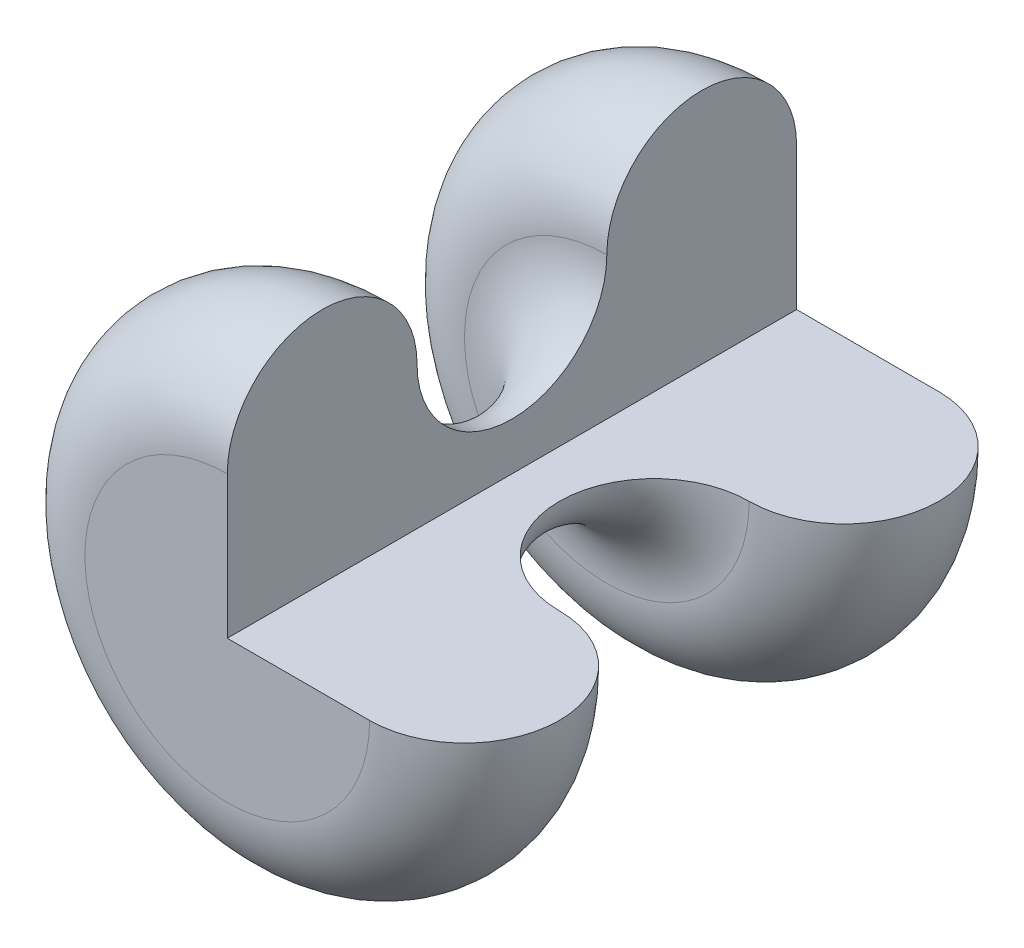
ISO-10303-21;
HEADER;
FILE_DESCRIPTION(('STEP AP214'),'2;1');
FILE_NAME('part.step','',(''),(''),'','','');
FILE_SCHEMA(('AUTOMOTIVE_DESIGN { 1 0 10303 214 1 1 1 1 }'));
ENDSEC;
DATA;
#1=APPLICATION_CONTEXT('core data for automotive mechanical design processes');
#2=APPLICATION_PROTOCOL_DEFINITION('international standard','automotive_design',2000,#1);
#3=PRODUCT_CONTEXT('',#1,'mechanical');
#4=PRODUCT('Part','Part','',(#3));
#5=PRODUCT_RELATED_PRODUCT_CATEGORY('part','',(#4));
#6=PRODUCT_DEFINITION_FORMATION('','',#4);
#7=PRODUCT_DEFINITION_CONTEXT('part definition',#1,'design');
#8=PRODUCT_DEFINITION('design','',#6,#7);
#9=PRODUCT_DEFINITION_SHAPE('','',#8);
#10=(LENGTH_UNIT() NAMED_UNIT(*) SI_UNIT(.MILLI.,.METRE.));
#11=(NAMED_UNIT(*) PLANE_ANGLE_UNIT() SI_UNIT($,.RADIAN.));
#12=(NAMED_UNIT(*) SI_UNIT($,.STERADIAN.) SOLID_ANGLE_UNIT());
#13=UNCERTAINTY_MEASURE_WITH_UNIT(LENGTH_MEASURE(1.E-05),#10,'distance_accuracy_value','');
#14=(GEOMETRIC_REPRESENTATION_CONTEXT(3) GLOBAL_UNCERTAINTY_ASSIGNED_CONTEXT((#13)) GLOBAL_UNIT_ASSIGNED_CONTEXT((#10,
#11,#12)) REPRESENTATION_CONTEXT('',''));
#15=CARTESIAN_POINT('',(0.,0.,0.));
#16=DIRECTION('',(0.,0.,1.));
#17=DIRECTION('',(1.,0.,0.));
#18=AXIS2_PLACEMENT_3D('',#15,#16,#17);
#19=CARTESIAN_POINT('',(0.,0.,24.3622568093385));
#20=DIRECTION('',(0.,0.,1.));
#21=DIRECTION('',(1.,0.,0.));
#22=AXIS2_PLACEMENT_3D('',#19,#20,#21);
#23=PLANE('',#22);
#24=CARTESIAN_POINT('',(0.,0.,24.3622568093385));
#25=DIRECTION('',(0.,0.,1.));
#26=DIRECTION('',(1.,0.,0.));
#27=AXIS2_PLACEMENT_3D('',#24,#25,#26);
#28=CIRCLE('',#27,30.2428015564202);
#29=CARTESIAN_POINT('',(3.02898743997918E-13,30.2428015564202,24.3622568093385));
#30=VERTEX_POINT('',#29);
#31=CARTESIAN_POINT('',(30.2428015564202,0.,24.3622568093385));
#32=VERTEX_POINT('',#31);
#33=EDGE_CURVE('E11',#30,#32,#28,.T.);
#34=ORIENTED_EDGE('',*,*,#33,.T.);
#35=DIRECTION('',(1.,0.,0.));
#36=VECTOR('',#35,1.);
#37=CARTESIAN_POINT('',(0.,0.,24.3622568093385));
#38=LINE('',#37,#36);
#39=CARTESIAN_POINT('',(0.,0.,24.3622568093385));
#40=VERTEX_POINT('',#39);
#41=EDGE_CURVE('E79',#40,#32,#38,.T.);
#42=ORIENTED_EDGE('',*,*,#41,.F.);
#43=DIRECTION('',(0.,1.,0.));
#44=VECTOR('',#43,1.);
#45=CARTESIAN_POINT('',(0.,0.,24.3622568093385));
#46=LINE('',#45,#44);
#47=EDGE_CURVE('E81',#40,#30,#46,.T.);
#48=ORIENTED_EDGE('',*,*,#47,.T.);
#49=EDGE_LOOP('',(#34,#42,#48));
#50=FACE_BOUND('',#49,.T.);
#51=ADVANCED_FACE('F32',(#50),#23,.T.);
#52=CARTESIAN_POINT('',(0.,0.,4.20038910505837));
#53=DIRECTION('',(0.,0.,1.));
#54=DIRECTION('',(1.,0.,0.));
#55=AXIS2_PLACEMENT_3D('',#52,#53,#54);
#56=TOROIDAL_SURFACE('',#55,30.2428015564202,20.1618677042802);
#57=CARTESIAN_POINT('',(0.,0.,-15.9614785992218));
#58=DIRECTION('',(0.,0.,1.));
#59=DIRECTION('',(1.,0.,0.));
#60=AXIS2_PLACEMENT_3D('',#57,#58,#59);
#61=CIRCLE('',#60,30.2428015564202);
#62=CARTESIAN_POINT('',(3.02898743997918E-13,30.2428015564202,-15.9614785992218));
#63=VERTEX_POINT('',#62);
#64=CARTESIAN_POINT('',(30.2428015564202,0.,-15.9614785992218));
#65=VERTEX_POINT('',#64);
#66=EDGE_CURVE('E39',#63,#65,#61,.T.);
#67=ORIENTED_EDGE('',*,*,#66,.T.);
#68=CARTESIAN_POINT('',(30.2428015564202,0.,4.20038910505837));
#69=DIRECTION('',(0.,1.,0.));
#70=DIRECTION('',(0.,0.,1.));
#71=AXIS2_PLACEMENT_3D('',#68,#69,#70);
#72=CIRCLE('',#71,20.1618677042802);
#73=EDGE_CURVE('E89',#32,#65,#72,.T.);
#74=ORIENTED_EDGE('',*,*,#73,.F.);
#75=ORIENTED_EDGE('',*,*,#33,.F.);
#76=CARTESIAN_POINT('',(3.02898743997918E-13,30.2428015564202,4.20038910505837));
#77=DIRECTION('',(-1.,0.,0.));
#78=DIRECTION('',(0.,0.,1.));
#79=AXIS2_PLACEMENT_3D('',#76,#77,#78);
#80=CIRCLE('',#79,20.1618677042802);
#81=EDGE_CURVE('E103',#30,#63,#80,.T.);
#82=ORIENTED_EDGE('',*,*,#81,.T.);
#83=EDGE_LOOP('',(#67,#74,#75,#82));
#84=FACE_BOUND('',#83,.T.);
#85=ADVANCED_FACE('F93',(#84),#56,.T.);
#86=CARTESIAN_POINT('',(0.,0.,-36.1233463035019));
#87=DIRECTION('',(0.,0.,1.));
#88=DIRECTION('',(1.,0.,0.));
#89=AXIS2_PLACEMENT_3D('',#86,#87,#88);
#90=TOROIDAL_SURFACE('',#89,30.2428015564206,20.1618677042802);
#91=CARTESIAN_POINT('',(0.,0.,-56.2852140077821));
#92=DIRECTION('',(0.,0.,1.));
#93=DIRECTION('',(1.,0.,0.));
#94=AXIS2_PLACEMENT_3D('',#91,#92,#93);
#95=CIRCLE('',#94,30.2428015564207);
#96=CARTESIAN_POINT('',(3.02898743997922E-13,30.2428015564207,-56.2852140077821));
#97=VERTEX_POINT('',#96);
#98=CARTESIAN_POINT('',(30.2428015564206,0.,-56.2852140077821));
#99=VERTEX_POINT('',#98);
#100=EDGE_CURVE('E113',#97,#99,#95,.T.);
#101=ORIENTED_EDGE('',*,*,#100,.T.);
#102=CARTESIAN_POINT('',(30.2428015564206,0.,-36.1233463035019));
#103=DIRECTION('',(0.,-1.,0.));
#104=DIRECTION('',(0.,0.,-1.));
#105=AXIS2_PLACEMENT_3D('',#102,#103,#104);
#106=CIRCLE('',#105,20.1618677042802);
#107=EDGE_CURVE('E94',#65,#99,#106,.T.);
#108=ORIENTED_EDGE('',*,*,#107,.F.);
#109=ORIENTED_EDGE('',*,*,#66,.F.);
#110=CARTESIAN_POINT('',(3.02898743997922E-13,30.2428015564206,-36.1233463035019));
#111=DIRECTION('',(1.,0.,0.));
#112=DIRECTION('',(0.,0.,-1.));
#113=AXIS2_PLACEMENT_3D('',#110,#111,#112);
#114=CIRCLE('',#113,20.1618677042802);
#115=EDGE_CURVE('E105',#63,#97,#114,.T.);
#116=ORIENTED_EDGE('',*,*,#115,.T.);
#117=EDGE_LOOP('',(#101,#108,#109,#116));
#118=FACE_BOUND('',#117,.T.);
#119=ADVANCED_FACE('F115',(#118),#90,.F.);
#120=CARTESIAN_POINT('',(0.,0.,-76.4470817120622));
#121=DIRECTION('',(0.,0.,1.));
#122=DIRECTION('',(1.,0.,0.));
#123=AXIS2_PLACEMENT_3D('',#120,#121,#122);
#124=TOROIDAL_SURFACE('',#123,30.2428015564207,20.1618677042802);
#125=CARTESIAN_POINT('',(0.,0.,-96.6089494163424));
#126=DIRECTION('',(0.,0.,1.));
#127=DIRECTION('',(1.,0.,0.));
#128=AXIS2_PLACEMENT_3D('',#125,#126,#127);
#129=CIRCLE('',#128,30.2428015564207);
#130=CARTESIAN_POINT('',(3.02898743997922E-13,30.2428015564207,-96.6089494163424));
#131=VERTEX_POINT('',#130);
#132=CARTESIAN_POINT('',(30.2428015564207,0.,-96.6089494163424));
#133=VERTEX_POINT('',#132);
#134=EDGE_CURVE('E53',#131,#133,#129,.T.);
#135=ORIENTED_EDGE('',*,*,#134,.T.);
#136=CARTESIAN_POINT('',(30.2428015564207,0.,-76.4470817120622));
#137=DIRECTION('',(0.,1.,0.));
#138=DIRECTION('',(0.,0.,1.));
#139=AXIS2_PLACEMENT_3D('',#136,#137,#138);
#140=CIRCLE('',#139,20.1618677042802);
#141=EDGE_CURVE('E96',#99,#133,#140,.T.);
#142=ORIENTED_EDGE('',*,*,#141,.F.);
#143=ORIENTED_EDGE('',*,*,#100,.F.);
#144=CARTESIAN_POINT('',(3.02898743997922E-13,30.2428015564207,-76.4470817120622));
#145=DIRECTION('',(-1.,0.,0.));
#146=DIRECTION('',(0.,0.,1.));
#147=AXIS2_PLACEMENT_3D('',#144,#145,#146);
#148=CIRCLE('',#147,20.1618677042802);
#149=EDGE_CURVE('E108',#97,#131,#148,.T.);
#150=ORIENTED_EDGE('',*,*,#149,.T.);
#151=EDGE_LOOP('',(#135,#142,#143,#150));
#152=FACE_BOUND('',#151,.T.);
#153=ADVANCED_FACE('F120',(#152),#124,.T.);
#154=CARTESIAN_POINT('',(3.02898743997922E-13,30.2428015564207,-96.6089494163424));
#155=DIRECTION('',(0.,0.,-1.));
#156=DIRECTION('',(-1.,0.,0.));
#157=AXIS2_PLACEMENT_3D('',#154,#155,#156);
#158=PLANE('',#157);
#159=DIRECTION('',(0.,-1.,0.));
#160=VECTOR('',#159,1.);
#161=CARTESIAN_POINT('',(3.02898743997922E-13,30.2428015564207,-96.6089494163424));
#162=LINE('',#161,#160);
#163=CARTESIAN_POINT('',(0.,0.,-96.6089494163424));
#164=VERTEX_POINT('',#163);
#165=EDGE_CURVE('E110',#131,#164,#162,.T.);
#166=ORIENTED_EDGE('',*,*,#165,.T.);
#167=DIRECTION('',(-1.,0.,0.));
#168=VECTOR('',#167,1.);
#169=CARTESIAN_POINT('',(30.2428015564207,0.,-96.6089494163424));
#170=LINE('',#169,#168);
#171=EDGE_CURVE('E46',#133,#164,#170,.T.);
#172=ORIENTED_EDGE('',*,*,#171,.F.);
#173=ORIENTED_EDGE('',*,*,#134,.F.);
#174=EDGE_LOOP('',(#166,#172,#173));
#175=FACE_BOUND('',#174,.T.);
#176=ADVANCED_FACE('F124',(#175),#158,.T.);
#177=CARTESIAN_POINT('',(3.02898743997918E-13,30.2428015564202,4.20038910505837));
#178=DIRECTION('',(-1.,0.,0.));
#179=DIRECTION('',(0.,0.,1.));
#180=AXIS2_PLACEMENT_3D('',#177,#178,#179);
#181=PLANE('',#180);
#182=DIRECTION('',(0.,0.,1.));
#183=VECTOR('',#182,1.);
#184=CARTESIAN_POINT('',(0.,0.,-96.6089494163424));
#185=LINE('',#184,#183);
#186=EDGE_CURVE('E91',#164,#40,#185,.T.);
#187=ORIENTED_EDGE('',*,*,#186,.F.);
#188=ORIENTED_EDGE('',*,*,#165,.F.);
#189=ORIENTED_EDGE('',*,*,#149,.F.);
#190=ORIENTED_EDGE('',*,*,#115,.F.);
#191=ORIENTED_EDGE('',*,*,#81,.F.);
#192=ORIENTED_EDGE('',*,*,#47,.F.);
#193=EDGE_LOOP('',(#187,#188,#189,#190,#191,#192));
#194=FACE_BOUND('',#193,.T.);
#195=ADVANCED_FACE('F123',(#194),#181,.F.);
#196=CARTESIAN_POINT('',(30.2428015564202,0.,4.20038910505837));
#197=DIRECTION('',(0.,1.,0.));
#198=DIRECTION('',(0.,0.,1.));
#199=AXIS2_PLACEMENT_3D('',#196,#197,#198);
#200=PLANE('',#199);
#201=ORIENTED_EDGE('',*,*,#186,.T.);
#202=ORIENTED_EDGE('',*,*,#41,.T.);
#203=ORIENTED_EDGE('',*,*,#73,.T.);
#204=ORIENTED_EDGE('',*,*,#107,.T.);
#205=ORIENTED_EDGE('',*,*,#141,.T.);
#206=ORIENTED_EDGE('',*,*,#171,.T.);
#207=EDGE_LOOP('',(#201,#202,#203,#204,#205,#206));
#208=FACE_BOUND('',#207,.T.);
#209=ADVANCED_FACE('F87',(#208),#200,.T.);
#210=CLOSED_SHELL('',(#51,#85,#119,#153,#176,#195,#209));
#211=MANIFOLD_SOLID_BREP('B2',#210);
#212=ADVANCED_BREP_SHAPE_REPRESENTATION('',(#18,#211),#14);
#213=SHAPE_DEFINITION_REPRESENTATION(#9,#212);
ENDSEC;
END-ISO-10303-21;
